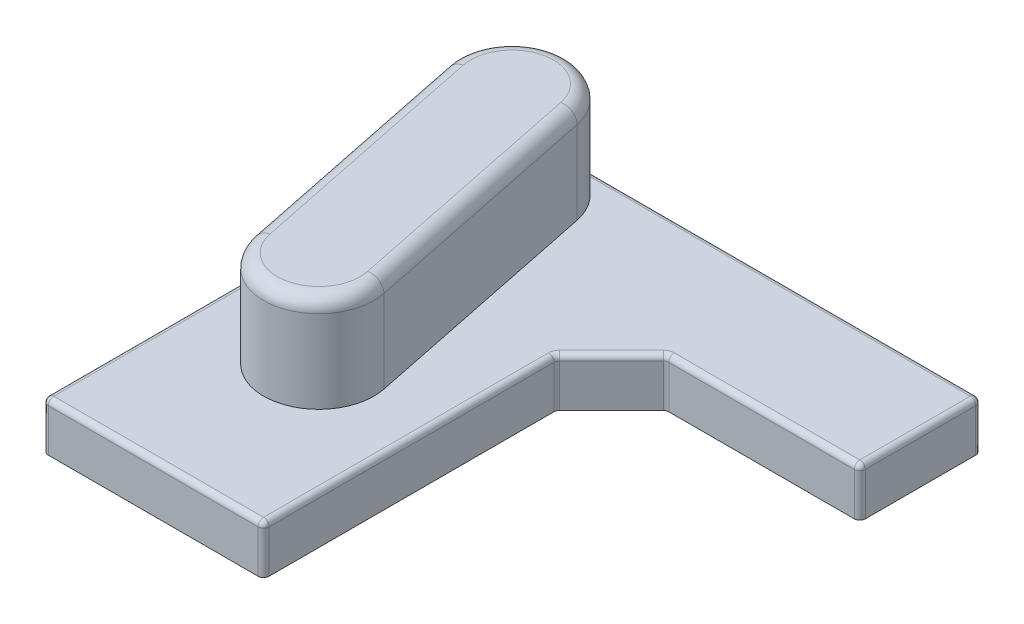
ISO-10303-21;
HEADER;
FILE_DESCRIPTION(('STEP AP214'),'2;1');
FILE_NAME('part.step','',(''),(''),'','','');
FILE_SCHEMA(('AUTOMOTIVE_DESIGN { 1 0 10303 214 1 1 1 1 }'));
ENDSEC;
DATA;
#1=APPLICATION_CONTEXT('core data for automotive mechanical design processes');
#2=APPLICATION_PROTOCOL_DEFINITION('international standard','automotive_design',2000,#1);
#3=PRODUCT_CONTEXT('',#1,'mechanical');
#4=PRODUCT('Part','Part','',(#3));
#5=PRODUCT_RELATED_PRODUCT_CATEGORY('part','',(#4));
#6=PRODUCT_DEFINITION_FORMATION('','',#4);
#7=PRODUCT_DEFINITION_CONTEXT('part definition',#1,'design');
#8=PRODUCT_DEFINITION('design','',#6,#7);
#9=PRODUCT_DEFINITION_SHAPE('','',#8);
#10=(LENGTH_UNIT() NAMED_UNIT(*) SI_UNIT(.MILLI.,.METRE.));
#11=(NAMED_UNIT(*) PLANE_ANGLE_UNIT() SI_UNIT($,.RADIAN.));
#12=(NAMED_UNIT(*) SI_UNIT($,.STERADIAN.) SOLID_ANGLE_UNIT());
#13=UNCERTAINTY_MEASURE_WITH_UNIT(LENGTH_MEASURE(1.E-05),#10,'distance_accuracy_value','');
#14=(GEOMETRIC_REPRESENTATION_CONTEXT(3) GLOBAL_UNCERTAINTY_ASSIGNED_CONTEXT((#13)) GLOBAL_UNIT_ASSIGNED_CONTEXT((#10,
#11,#12)) REPRESENTATION_CONTEXT('',''));
#15=CARTESIAN_POINT('',(0.,0.,0.));
#16=DIRECTION('',(0.,0.,1.));
#17=DIRECTION('',(1.,0.,0.));
#18=AXIS2_PLACEMENT_3D('',#15,#16,#17);
#19=CARTESIAN_POINT('',(0.,17.5,0.));
#20=DIRECTION('',(0.,-1.,0.));
#21=DIRECTION('',(0.,0.,-1.));
#22=AXIS2_PLACEMENT_3D('',#19,#20,#21);
#23=PLANE('',#22);
#24=CARTESIAN_POINT('',(22.,17.5,-148.));
#25=DIRECTION('',(0.,1.,0.));
#26=DIRECTION('',(0.,0.,1.));
#27=AXIS2_PLACEMENT_3D('',#24,#25,#26);
#28=CIRCLE('',#27,20.);
#29=CARTESIAN_POINT('',(41.5942986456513,17.5,-152.007924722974));
#30=VERTEX_POINT('',#29);
#31=CARTESIAN_POINT('',(22.,17.5,-168.));
#32=VERTEX_POINT('',#31);
#33=EDGE_CURVE('E250',#30,#32,#28,.T.);
#34=ORIENTED_EDGE('',*,*,#33,.F.);
#35=DIRECTION('',(-0.200396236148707,0.,-0.979714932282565));
#36=VECTOR('',#35,1.);
#37=CARTESIAN_POINT('',(41.5942986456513,17.5,-152.007924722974));
#38=LINE('',#37,#36);
#39=CARTESIAN_POINT('',(59.5942986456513,17.5,-64.0079247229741));
#40=VERTEX_POINT('',#39);
#41=EDGE_CURVE('E372',#40,#30,#38,.T.);
#42=ORIENTED_EDGE('',*,*,#41,.F.);
#43=CARTESIAN_POINT('',(40.,17.5,-60.));
#44=DIRECTION('',(0.,1.,0.));
#45=DIRECTION('',(0.,0.,1.));
#46=AXIS2_PLACEMENT_3D('',#43,#44,#45);
#47=CIRCLE('',#46,20.);
#48=CARTESIAN_POINT('',(20.4057013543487,17.5,-55.9920752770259));
#49=VERTEX_POINT('',#48);
#50=EDGE_CURVE('E920',#49,#40,#47,.T.);
#51=ORIENTED_EDGE('',*,*,#50,.F.);
#52=DIRECTION('',(0.200396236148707,0.,0.979714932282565));
#53=VECTOR('',#52,1.);
#54=CARTESIAN_POINT('',(2.40570135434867,17.5,-143.992075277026));
#55=LINE('',#54,#53);
#56=CARTESIAN_POINT('',(2.40570135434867,17.5,-143.992075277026));
#57=VERTEX_POINT('',#56);
#58=EDGE_CURVE('E248',#57,#49,#55,.T.);
#59=ORIENTED_EDGE('',*,*,#58,.F.);
#60=CARTESIAN_POINT('',(1.99999999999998,17.5,-148.));
#61=VERTEX_POINT('',#60);
#62=EDGE_CURVE('E244',#61,#57,#28,.T.);
#63=ORIENTED_EDGE('',*,*,#62,.F.);
#64=DIRECTION('',(0.,0.,1.));
#65=VECTOR('',#64,1.);
#66=CARTESIAN_POINT('',(2.,17.5,0.));
#67=LINE('',#66,#65);
#68=CARTESIAN_POINT('',(2.,17.5,-2.));
#69=VERTEX_POINT('',#68);
#70=EDGE_CURVE('E233',#61,#69,#67,.T.);
#71=ORIENTED_EDGE('',*,*,#70,.T.);
#72=DIRECTION('',(1.,0.,0.));
#73=VECTOR('',#72,1.);
#74=CARTESIAN_POINT('',(0.,17.5,-2.));
#75=LINE('',#74,#73);
#76=CARTESIAN_POINT('',(78.,17.5,-2.));
#77=VERTEX_POINT('',#76);
#78=EDGE_CURVE('E240',#69,#77,#75,.T.);
#79=ORIENTED_EDGE('',*,*,#78,.T.);
#80=DIRECTION('',(0.,0.,-1.));
#81=VECTOR('',#80,1.);
#82=CARTESIAN_POINT('',(78.,17.5,0.));
#83=LINE('',#82,#81);
#84=CARTESIAN_POINT('',(78.,17.5,-105.191548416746));
#85=VERTEX_POINT('',#84);
#86=EDGE_CURVE('E261',#77,#85,#83,.T.);
#87=ORIENTED_EDGE('',*,*,#86,.T.);
#88=CARTESIAN_POINT('',(82.,17.5,-105.191548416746));
#89=DIRECTION('',(0.,-1.,0.));
#90=DIRECTION('',(0.,0.,-1.));
#91=AXIS2_PLACEMENT_3D('',#88,#89,#90);
#92=CIRCLE('',#91,4.);
#93=CARTESIAN_POINT('',(79.1715728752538,17.5,-108.019975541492));
#94=VERTEX_POINT('',#93);
#95=EDGE_CURVE('E263',#85,#94,#92,.T.);
#96=ORIENTED_EDGE('',*,*,#95,.T.);
#97=DIRECTION('',(0.707106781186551,0.,-0.707106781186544));
#98=VECTOR('',#97,1.);
#99=CARTESIAN_POINT('',(-14.4242013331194,17.5,-14.4242013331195));
#100=LINE('',#99,#98);
#101=CARTESIAN_POINT('',(97.9800244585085,17.5,-126.828427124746));
#102=VERTEX_POINT('',#101);
#103=EDGE_CURVE('E265',#94,#102,#100,.T.);
#104=ORIENTED_EDGE('',*,*,#103,.T.);
#105=CARTESIAN_POINT('',(100.808451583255,17.5,-124.));
#106=DIRECTION('',(0.,-1.,0.));
#107=DIRECTION('',(0.,0.,-1.));
#108=AXIS2_PLACEMENT_3D('',#105,#106,#107);
#109=CIRCLE('',#108,4.);
#110=CARTESIAN_POINT('',(100.808451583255,17.5,-128.));
#111=VERTEX_POINT('',#110);
#112=EDGE_CURVE('E267',#102,#111,#109,.T.);
#113=ORIENTED_EDGE('',*,*,#112,.T.);
#114=DIRECTION('',(1.,0.,0.));
#115=VECTOR('',#114,1.);
#116=CARTESIAN_POINT('',(0.,17.5,-128.));
#117=LINE('',#116,#115);
#118=CARTESIAN_POINT('',(168.,17.5,-128.));
#119=VERTEX_POINT('',#118);
#120=EDGE_CURVE('E269',#111,#119,#117,.T.);
#121=ORIENTED_EDGE('',*,*,#120,.T.);
#122=DIRECTION('',(0.,0.,-1.));
#123=VECTOR('',#122,1.);
#124=CARTESIAN_POINT('',(168.,17.5,0.));
#125=LINE('',#124,#123);
#126=CARTESIAN_POINT('',(168.,17.5,-168.));
#127=VERTEX_POINT('',#126);
#128=EDGE_CURVE('E256',#119,#127,#125,.T.);
#129=ORIENTED_EDGE('',*,*,#128,.T.);
#130=DIRECTION('',(-1.,0.,0.));
#131=VECTOR('',#130,1.);
#132=CARTESIAN_POINT('',(0.,17.5,-168.));
#133=LINE('',#132,#131);
#134=EDGE_CURVE('E254',#127,#32,#133,.T.);
#135=ORIENTED_EDGE('',*,*,#134,.T.);
#136=EDGE_LOOP('',(#34,#42,#51,#59,#63,#71,#79,#87,#96,#104,#113,#121,#129,#135));
#137=FACE_BOUND('',#136,.T.);
#138=ADVANCED_FACE('F50',(#137),#23,.F.);
#139=CARTESIAN_POINT('',(80.,17.5,0.));
#140=DIRECTION('',(0.,0.,-1.));
#141=DIRECTION('',(-1.,0.,0.));
#142=AXIS2_PLACEMENT_3D('',#139,#140,#141);
#143=PLANE('',#142);
#144=DIRECTION('',(0.,-1.,0.));
#145=VECTOR('',#144,1.);
#146=CARTESIAN_POINT('',(78.,17.5,0.));
#147=LINE('',#146,#145);
#148=CARTESIAN_POINT('',(78.,0.,0.));
#149=VERTEX_POINT('',#148);
#150=CARTESIAN_POINT('',(78.,15.5,0.));
#151=VERTEX_POINT('',#150);
#152=EDGE_CURVE('E848',#149,#151,#147,.F.);
#153=ORIENTED_EDGE('',*,*,#152,.T.);
#154=DIRECTION('',(1.,0.,0.));
#155=VECTOR('',#154,1.);
#156=CARTESIAN_POINT('',(80.,15.5,0.));
#157=LINE('',#156,#155);
#158=CARTESIAN_POINT('',(2.,15.5,0.));
#159=VERTEX_POINT('',#158);
#160=EDGE_CURVE('E284',#151,#159,#157,.F.);
#161=ORIENTED_EDGE('',*,*,#160,.T.);
#162=DIRECTION('',(0.,-1.,0.));
#163=VECTOR('',#162,1.);
#164=CARTESIAN_POINT('',(2.,17.5,0.));
#165=LINE('',#164,#163);
#166=CARTESIAN_POINT('',(2.,0.,0.));
#167=VERTEX_POINT('',#166);
#168=EDGE_CURVE('E846',#159,#167,#165,.T.);
#169=ORIENTED_EDGE('',*,*,#168,.T.);
#170=DIRECTION('',(1.,0.,0.));
#171=VECTOR('',#170,1.);
#172=CARTESIAN_POINT('',(80.,0.,0.));
#173=LINE('',#172,#171);
#174=EDGE_CURVE('E331',#167,#149,#173,.T.);
#175=ORIENTED_EDGE('',*,*,#174,.T.);
#176=EDGE_LOOP('',(#153,#161,#169,#175));
#177=FACE_BOUND('',#176,.T.);
#178=ADVANCED_FACE('F389',(#177),#143,.F.);
#179=CARTESIAN_POINT('',(80.,17.5,-106.019975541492));
#180=DIRECTION('',(-1.,0.,0.));
#181=DIRECTION('',(0.,0.,1.));
#182=AXIS2_PLACEMENT_3D('',#179,#180,#181);
#183=PLANE('',#182);
#184=DIRECTION('',(0.,-1.,0.));
#185=VECTOR('',#184,1.);
#186=CARTESIAN_POINT('',(80.,17.5,-105.191548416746));
#187=LINE('',#186,#185);
#188=CARTESIAN_POINT('',(80.,0.,-105.191548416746));
#189=VERTEX_POINT('',#188);
#190=CARTESIAN_POINT('',(80.,15.5,-105.191548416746));
#191=VERTEX_POINT('',#190);
#192=EDGE_CURVE('E843',#189,#191,#187,.F.);
#193=ORIENTED_EDGE('',*,*,#192,.T.);
#194=DIRECTION('',(0.,0.,-1.));
#195=VECTOR('',#194,1.);
#196=CARTESIAN_POINT('',(80.,15.5,-106.019975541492));
#197=LINE('',#196,#195);
#198=CARTESIAN_POINT('',(80.,15.5,-2.));
#199=VERTEX_POINT('',#198);
#200=EDGE_CURVE('E280',#191,#199,#197,.F.);
#201=ORIENTED_EDGE('',*,*,#200,.T.);
#202=DIRECTION('',(0.,-1.,0.));
#203=VECTOR('',#202,1.);
#204=CARTESIAN_POINT('',(80.,17.5,-2.));
#205=LINE('',#204,#203);
#206=CARTESIAN_POINT('',(80.,0.,-2.));
#207=VERTEX_POINT('',#206);
#208=EDGE_CURVE('E841',#199,#207,#205,.T.);
#209=ORIENTED_EDGE('',*,*,#208,.T.);
#210=DIRECTION('',(0.,0.,-1.));
#211=VECTOR('',#210,1.);
#212=CARTESIAN_POINT('',(80.,0.,-106.019975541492));
#213=LINE('',#212,#211);
#214=EDGE_CURVE('E791',#207,#189,#213,.T.);
#215=ORIENTED_EDGE('',*,*,#214,.T.);
#216=EDGE_LOOP('',(#193,#201,#209,#215));
#217=FACE_BOUND('',#216,.T.);
#218=ADVANCED_FACE('F396',(#217),#183,.F.);
#219=CARTESIAN_POINT('',(80.,17.5,-106.019975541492));
#220=DIRECTION('',(-0.707106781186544,0.,-0.707106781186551));
#221=DIRECTION('',(-0.707106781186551,0.,0.707106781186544));
#222=AXIS2_PLACEMENT_3D('',#219,#220,#221);
#223=PLANE('',#222);
#224=DIRECTION('',(0.,-1.,0.));
#225=VECTOR('',#224,1.);
#226=CARTESIAN_POINT('',(99.3942380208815,17.5,-125.414213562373));
#227=LINE('',#226,#225);
#228=CARTESIAN_POINT('',(99.3942380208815,0.,-125.414213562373));
#229=VERTEX_POINT('',#228);
#230=CARTESIAN_POINT('',(99.3942380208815,15.5,-125.414213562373));
#231=VERTEX_POINT('',#230);
#232=EDGE_CURVE('E836',#229,#231,#227,.F.);
#233=ORIENTED_EDGE('',*,*,#232,.T.);
#234=DIRECTION('',(0.707106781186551,0.,-0.707106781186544));
#235=VECTOR('',#234,1.);
#236=CARTESIAN_POINT('',(80.,15.5,-106.019975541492));
#237=LINE('',#236,#235);
#238=CARTESIAN_POINT('',(80.5857864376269,15.5,-106.605761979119));
#239=VERTEX_POINT('',#238);
#240=EDGE_CURVE('E276',#231,#239,#237,.F.);
#241=ORIENTED_EDGE('',*,*,#240,.T.);
#242=DIRECTION('',(0.,-1.,0.));
#243=VECTOR('',#242,1.);
#244=CARTESIAN_POINT('',(80.5857864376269,0.,-106.605761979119));
#245=LINE('',#244,#243);
#246=CARTESIAN_POINT('',(80.5857864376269,0.,-106.605761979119));
#247=VERTEX_POINT('',#246);
#248=EDGE_CURVE('E839',#239,#247,#245,.T.);
#249=ORIENTED_EDGE('',*,*,#248,.T.);
#250=DIRECTION('',(0.707106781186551,0.,-0.707106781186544));
#251=VECTOR('',#250,1.);
#252=CARTESIAN_POINT('',(80.,0.,-106.019975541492));
#253=LINE('',#252,#251);
#254=EDGE_CURVE('E794',#247,#229,#253,.T.);
#255=ORIENTED_EDGE('',*,*,#254,.T.);
#256=EDGE_LOOP('',(#233,#241,#249,#255));
#257=FACE_BOUND('',#256,.T.);
#258=ADVANCED_FACE('F423',(#257),#223,.F.);
#259=CARTESIAN_POINT('',(170.,17.5,-126.));
#260=DIRECTION('',(0.,0.,-1.));
#261=DIRECTION('',(-1.,0.,0.));
#262=AXIS2_PLACEMENT_3D('',#259,#260,#261);
#263=PLANE('',#262);
#264=DIRECTION('',(0.,-1.,0.));
#265=VECTOR('',#264,1.);
#266=CARTESIAN_POINT('',(168.,17.5,-126.));
#267=LINE('',#266,#265);
#268=CARTESIAN_POINT('',(168.,0.,-126.));
#269=VERTEX_POINT('',#268);
#270=CARTESIAN_POINT('',(168.,15.5,-126.));
#271=VERTEX_POINT('',#270);
#272=EDGE_CURVE('E833',#269,#271,#267,.F.);
#273=ORIENTED_EDGE('',*,*,#272,.T.);
#274=DIRECTION('',(1.,0.,0.));
#275=VECTOR('',#274,1.);
#276=CARTESIAN_POINT('',(170.,15.5,-126.));
#277=LINE('',#276,#275);
#278=CARTESIAN_POINT('',(100.808451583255,15.5,-126.));
#279=VERTEX_POINT('',#278);
#280=EDGE_CURVE('E272',#271,#279,#277,.F.);
#281=ORIENTED_EDGE('',*,*,#280,.T.);
#282=DIRECTION('',(0.,-1.,0.));
#283=VECTOR('',#282,1.);
#284=CARTESIAN_POINT('',(100.808451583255,0.,-126.));
#285=LINE('',#284,#283);
#286=CARTESIAN_POINT('',(100.808451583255,0.,-126.));
#287=VERTEX_POINT('',#286);
#288=EDGE_CURVE('E831',#279,#287,#285,.T.);
#289=ORIENTED_EDGE('',*,*,#288,.T.);
#290=DIRECTION('',(1.,0.,0.));
#291=VECTOR('',#290,1.);
#292=CARTESIAN_POINT('',(170.,0.,-126.));
#293=LINE('',#292,#291);
#294=EDGE_CURVE('E797',#287,#269,#293,.T.);
#295=ORIENTED_EDGE('',*,*,#294,.T.);
#296=EDGE_LOOP('',(#273,#281,#289,#295));
#297=FACE_BOUND('',#296,.T.);
#298=ADVANCED_FACE('F419',(#297),#263,.F.);
#299=CARTESIAN_POINT('',(170.,17.5,-170.));
#300=DIRECTION('',(-1.,0.,0.));
#301=DIRECTION('',(0.,0.,1.));
#302=AXIS2_PLACEMENT_3D('',#299,#300,#301);
#303=PLANE('',#302);
#304=DIRECTION('',(0.,-1.,0.));
#305=VECTOR('',#304,1.);
#306=CARTESIAN_POINT('',(170.,17.5,-168.));
#307=LINE('',#306,#305);
#308=CARTESIAN_POINT('',(170.,0.,-168.));
#309=VERTEX_POINT('',#308);
#310=CARTESIAN_POINT('',(170.,15.5,-168.));
#311=VERTEX_POINT('',#310);
#312=EDGE_CURVE('E828',#309,#311,#307,.F.);
#313=ORIENTED_EDGE('',*,*,#312,.T.);
#314=DIRECTION('',(0.,0.,-1.));
#315=VECTOR('',#314,1.);
#316=CARTESIAN_POINT('',(170.,15.5,-170.));
#317=LINE('',#316,#315);
#318=CARTESIAN_POINT('',(170.,15.5,-128.));
#319=VERTEX_POINT('',#318);
#320=EDGE_CURVE('E295',#311,#319,#317,.F.);
#321=ORIENTED_EDGE('',*,*,#320,.T.);
#322=DIRECTION('',(0.,-1.,0.));
#323=VECTOR('',#322,1.);
#324=CARTESIAN_POINT('',(170.,17.5,-128.));
#325=LINE('',#324,#323);
#326=CARTESIAN_POINT('',(170.,0.,-128.));
#327=VERTEX_POINT('',#326);
#328=EDGE_CURVE('E826',#319,#327,#325,.T.);
#329=ORIENTED_EDGE('',*,*,#328,.T.);
#330=DIRECTION('',(0.,0.,-1.));
#331=VECTOR('',#330,1.);
#332=CARTESIAN_POINT('',(170.,0.,-170.));
#333=LINE('',#332,#331);
#334=EDGE_CURVE('E800',#327,#309,#333,.T.);
#335=ORIENTED_EDGE('',*,*,#334,.T.);
#336=EDGE_LOOP('',(#313,#321,#329,#335));
#337=FACE_BOUND('',#336,.T.);
#338=ADVANCED_FACE('F415',(#337),#303,.F.);
#339=CARTESIAN_POINT('',(0.,17.5,-170.));
#340=DIRECTION('',(0.,0.,1.));
#341=DIRECTION('',(1.,0.,0.));
#342=AXIS2_PLACEMENT_3D('',#339,#340,#341);
#343=PLANE('',#342);
#344=DIRECTION('',(0.,-1.,0.));
#345=VECTOR('',#344,1.);
#346=CARTESIAN_POINT('',(22.,17.5,-170.));
#347=LINE('',#346,#345);
#348=CARTESIAN_POINT('',(22.,0.,-170.));
#349=VERTEX_POINT('',#348);
#350=CARTESIAN_POINT('',(22.,15.5,-170.));
#351=VERTEX_POINT('',#350);
#352=EDGE_CURVE('E813',#349,#351,#347,.F.);
#353=ORIENTED_EDGE('',*,*,#352,.T.);
#354=DIRECTION('',(-1.,0.,0.));
#355=VECTOR('',#354,1.);
#356=CARTESIAN_POINT('',(0.,15.5,-170.));
#357=LINE('',#356,#355);
#358=CARTESIAN_POINT('',(168.,15.5,-170.));
#359=VERTEX_POINT('',#358);
#360=EDGE_CURVE('E291',#351,#359,#357,.F.);
#361=ORIENTED_EDGE('',*,*,#360,.T.);
#362=DIRECTION('',(0.,-1.,0.));
#363=VECTOR('',#362,1.);
#364=CARTESIAN_POINT('',(168.,17.5,-170.));
#365=LINE('',#364,#363);
#366=CARTESIAN_POINT('',(168.,0.,-170.));
#367=VERTEX_POINT('',#366);
#368=EDGE_CURVE('E816',#359,#367,#365,.T.);
#369=ORIENTED_EDGE('',*,*,#368,.T.);
#370=DIRECTION('',(-1.,0.,0.));
#371=VECTOR('',#370,1.);
#372=CARTESIAN_POINT('',(0.,0.,-170.));
#373=LINE('',#372,#371);
#374=EDGE_CURVE('E803',#367,#349,#373,.T.);
#375=ORIENTED_EDGE('',*,*,#374,.T.);
#376=EDGE_LOOP('',(#353,#361,#369,#375));
#377=FACE_BOUND('',#376,.T.);
#378=ADVANCED_FACE('F411',(#377),#343,.F.);
#379=CARTESIAN_POINT('',(0.,17.5,0.));
#380=DIRECTION('',(1.,0.,0.));
#381=DIRECTION('',(0.,0.,-1.));
#382=AXIS2_PLACEMENT_3D('',#379,#380,#381);
#383=PLANE('',#382);
#384=DIRECTION('',(0.,-1.,0.));
#385=VECTOR('',#384,1.);
#386=CARTESIAN_POINT('',(0.,17.5,-2.));
#387=LINE('',#386,#385);
#388=CARTESIAN_POINT('',(0.,0.,-2.));
#389=VERTEX_POINT('',#388);
#390=CARTESIAN_POINT('',(0.,15.5,-2.));
#391=VERTEX_POINT('',#390);
#392=EDGE_CURVE('E851',#389,#391,#387,.F.);
#393=ORIENTED_EDGE('',*,*,#392,.T.);
#394=DIRECTION('',(0.,0.,1.));
#395=VECTOR('',#394,1.);
#396=CARTESIAN_POINT('',(0.,15.5,0.));
#397=LINE('',#396,#395);
#398=CARTESIAN_POINT('',(0.,15.5,-148.));
#399=VERTEX_POINT('',#398);
#400=EDGE_CURVE('E288',#391,#399,#397,.F.);
#401=ORIENTED_EDGE('',*,*,#400,.T.);
#402=DIRECTION('',(0.,-1.,0.));
#403=VECTOR('',#402,1.);
#404=CARTESIAN_POINT('',(0.,17.5,-148.));
#405=LINE('',#404,#403);
#406=CARTESIAN_POINT('',(0.,0.,-148.));
#407=VERTEX_POINT('',#406);
#408=EDGE_CURVE('E808',#399,#407,#405,.T.);
#409=ORIENTED_EDGE('',*,*,#408,.T.);
#410=DIRECTION('',(0.,0.,1.));
#411=VECTOR('',#410,1.);
#412=CARTESIAN_POINT('',(0.,0.,0.));
#413=LINE('',#412,#411);
#414=EDGE_CURVE('E805',#407,#389,#413,.T.);
#415=ORIENTED_EDGE('',*,*,#414,.T.);
#416=EDGE_LOOP('',(#393,#401,#409,#415));
#417=FACE_BOUND('',#416,.T.);
#418=ADVANCED_FACE('F407',(#417),#383,.F.);
#419=CARTESIAN_POINT('',(0.,0.,0.));
#420=DIRECTION('',(0.,-1.,0.));
#421=DIRECTION('',(0.,0.,-1.));
#422=AXIS2_PLACEMENT_3D('',#419,#420,#421);
#423=PLANE('',#422);
#424=CARTESIAN_POINT('',(40.,0.,-60.));
#425=DIRECTION('',(0.,-1.,0.));
#426=DIRECTION('',(0.,0.,-1.));
#427=AXIS2_PLACEMENT_3D('',#424,#425,#426);
#428=CIRCLE('',#427,19.);
#429=CARTESIAN_POINT('',(40.,0.,-79.));
#430=VERTEX_POINT('',#429);
#431=EDGE_CURVE('E783',#430,#430,#428,.T.);
#432=ORIENTED_EDGE('',*,*,#431,.F.);
#433=EDGE_LOOP('',(#432));
#434=FACE_BOUND('',#433,.T.);
#435=ORIENTED_EDGE('',*,*,#374,.F.);
#436=CARTESIAN_POINT('',(168.,0.,-168.));
#437=DIRECTION('',(0.,-1.,0.));
#438=DIRECTION('',(0.,0.,-1.));
#439=AXIS2_PLACEMENT_3D('',#436,#437,#438);
#440=CIRCLE('',#439,2.);
#441=EDGE_CURVE('E824',#367,#309,#440,.T.);
#442=ORIENTED_EDGE('',*,*,#441,.T.);
#443=ORIENTED_EDGE('',*,*,#334,.F.);
#444=CARTESIAN_POINT('',(168.,0.,-128.));
#445=DIRECTION('',(0.,-1.,0.));
#446=DIRECTION('',(0.,0.,-1.));
#447=AXIS2_PLACEMENT_3D('',#444,#445,#446);
#448=CIRCLE('',#447,2.);
#449=EDGE_CURVE('E822',#327,#269,#448,.T.);
#450=ORIENTED_EDGE('',*,*,#449,.T.);
#451=ORIENTED_EDGE('',*,*,#294,.F.);
#452=CARTESIAN_POINT('',(100.808451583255,0.,-124.));
#453=DIRECTION('',(0.,-1.,0.));
#454=DIRECTION('',(0.,0.,-1.));
#455=AXIS2_PLACEMENT_3D('',#452,#453,#454);
#456=CIRCLE('',#455,2.);
#457=EDGE_CURVE('E856',#287,#229,#456,.F.);
#458=ORIENTED_EDGE('',*,*,#457,.T.);
#459=ORIENTED_EDGE('',*,*,#254,.F.);
#460=CARTESIAN_POINT('',(82.,0.,-105.191548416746));
#461=DIRECTION('',(0.,-1.,0.));
#462=DIRECTION('',(0.,0.,-1.));
#463=AXIS2_PLACEMENT_3D('',#460,#461,#462);
#464=CIRCLE('',#463,2.);
#465=EDGE_CURVE('E854',#247,#189,#464,.F.);
#466=ORIENTED_EDGE('',*,*,#465,.T.);
#467=ORIENTED_EDGE('',*,*,#214,.F.);
#468=CARTESIAN_POINT('',(78.,0.,-2.));
#469=DIRECTION('',(0.,-1.,0.));
#470=DIRECTION('',(0.,0.,-1.));
#471=AXIS2_PLACEMENT_3D('',#468,#469,#470);
#472=CIRCLE('',#471,2.);
#473=EDGE_CURVE('E820',#207,#149,#472,.T.);
#474=ORIENTED_EDGE('',*,*,#473,.T.);
#475=ORIENTED_EDGE('',*,*,#174,.F.);
#476=CARTESIAN_POINT('',(2.,0.,-2.));
#477=DIRECTION('',(0.,-1.,0.));
#478=DIRECTION('',(0.,0.,-1.));
#479=AXIS2_PLACEMENT_3D('',#476,#477,#478);
#480=CIRCLE('',#479,2.);
#481=EDGE_CURVE('E818',#167,#389,#480,.T.);
#482=ORIENTED_EDGE('',*,*,#481,.T.);
#483=ORIENTED_EDGE('',*,*,#414,.F.);
#484=CARTESIAN_POINT('',(22.,0.,-148.));
#485=DIRECTION('',(0.,-1.,0.));
#486=DIRECTION('',(0.,0.,-1.));
#487=AXIS2_PLACEMENT_3D('',#484,#485,#486);
#488=CIRCLE('',#487,22.);
#489=EDGE_CURVE('E810',#407,#349,#488,.T.);
#490=ORIENTED_EDGE('',*,*,#489,.T.);
#491=EDGE_LOOP('',(#435,#442,#443,#450,#451,#458,#459,#466,#467,#474,#475,#482,#483,#490));
#492=FACE_BOUND('',#491,.T.);
#493=ADVANCED_FACE('F403',(#434,#492),#423,.T.);
#494=CARTESIAN_POINT('',(22.,17.5,-148.));
#495=DIRECTION('',(0.,-1.,0.));
#496=DIRECTION('',(0.,0.,-1.));
#497=AXIS2_PLACEMENT_3D('',#494,#495,#496);
#498=CYLINDRICAL_SURFACE('',#497,22.);
#499=ORIENTED_EDGE('',*,*,#408,.F.);
#500=CARTESIAN_POINT('',(22.,15.5,-148.));
#501=DIRECTION('',(0.,-1.,0.));
#502=DIRECTION('',(0.,0.,-1.));
#503=AXIS2_PLACEMENT_3D('',#500,#501,#502);
#504=CIRCLE('',#503,22.);
#505=EDGE_CURVE('E226',#399,#351,#504,.T.);
#506=ORIENTED_EDGE('',*,*,#505,.T.);
#507=ORIENTED_EDGE('',*,*,#352,.F.);
#508=ORIENTED_EDGE('',*,*,#489,.F.);
#509=EDGE_LOOP('',(#499,#506,#507,#508));
#510=FACE_BOUND('',#509,.T.);
#511=ADVANCED_FACE('F406',(#510),#498,.T.);
#512=CARTESIAN_POINT('',(168.,17.5,-168.));
#513=DIRECTION('',(0.,-1.,0.));
#514=DIRECTION('',(0.,0.,-1.));
#515=AXIS2_PLACEMENT_3D('',#512,#513,#514);
#516=CYLINDRICAL_SURFACE('',#515,2.);
#517=ORIENTED_EDGE('',*,*,#368,.F.);
#518=CARTESIAN_POINT('',(168.,15.5,-168.));
#519=DIRECTION('',(0.,-1.,0.));
#520=DIRECTION('',(0.,0.,-1.));
#521=AXIS2_PLACEMENT_3D('',#518,#519,#520);
#522=CIRCLE('',#521,2.);
#523=EDGE_CURVE('E293',#359,#311,#522,.T.);
#524=ORIENTED_EDGE('',*,*,#523,.T.);
#525=ORIENTED_EDGE('',*,*,#312,.F.);
#526=ORIENTED_EDGE('',*,*,#441,.F.);
#527=EDGE_LOOP('',(#517,#524,#525,#526));
#528=FACE_BOUND('',#527,.T.);
#529=ADVANCED_FACE('F433',(#528),#516,.T.);
#530=CARTESIAN_POINT('',(168.,17.5,-128.));
#531=DIRECTION('',(0.,-1.,0.));
#532=DIRECTION('',(0.,0.,-1.));
#533=AXIS2_PLACEMENT_3D('',#530,#531,#532);
#534=CYLINDRICAL_SURFACE('',#533,2.);
#535=ORIENTED_EDGE('',*,*,#328,.F.);
#536=CARTESIAN_POINT('',(168.,15.5,-128.));
#537=DIRECTION('',(0.,-1.,0.));
#538=DIRECTION('',(0.,0.,-1.));
#539=AXIS2_PLACEMENT_3D('',#536,#537,#538);
#540=CIRCLE('',#539,2.);
#541=EDGE_CURVE('E858',#319,#271,#540,.T.);
#542=ORIENTED_EDGE('',*,*,#541,.T.);
#543=ORIENTED_EDGE('',*,*,#272,.F.);
#544=ORIENTED_EDGE('',*,*,#449,.F.);
#545=EDGE_LOOP('',(#535,#542,#543,#544));
#546=FACE_BOUND('',#545,.T.);
#547=ADVANCED_FACE('F437',(#546),#534,.T.);
#548=CARTESIAN_POINT('',(82.,17.5,-105.191548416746));
#549=DIRECTION('',(0.,1.,0.));
#550=DIRECTION('',(0.,0.,1.));
#551=AXIS2_PLACEMENT_3D('',#548,#549,#550);
#552=CYLINDRICAL_SURFACE('',#551,2.);
#553=ORIENTED_EDGE('',*,*,#248,.F.);
#554=CARTESIAN_POINT('',(82.,15.5,-105.191548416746));
#555=DIRECTION('',(0.,-1.,0.));
#556=DIRECTION('',(0.,0.,-1.));
#557=AXIS2_PLACEMENT_3D('',#554,#555,#556);
#558=CIRCLE('',#557,2.);
#559=EDGE_CURVE('E278',#239,#191,#558,.F.);
#560=ORIENTED_EDGE('',*,*,#559,.T.);
#561=ORIENTED_EDGE('',*,*,#192,.F.);
#562=ORIENTED_EDGE('',*,*,#465,.F.);
#563=EDGE_LOOP('',(#553,#560,#561,#562));
#564=FACE_BOUND('',#563,.T.);
#565=ADVANCED_FACE('F441',(#564),#552,.F.);
#566=CARTESIAN_POINT('',(100.808451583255,17.5,-124.));
#567=DIRECTION('',(0.,1.,0.));
#568=DIRECTION('',(0.,0.,1.));
#569=AXIS2_PLACEMENT_3D('',#566,#567,#568);
#570=CYLINDRICAL_SURFACE('',#569,2.);
#571=ORIENTED_EDGE('',*,*,#288,.F.);
#572=CARTESIAN_POINT('',(100.808451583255,15.5,-124.));
#573=DIRECTION('',(0.,-1.,0.));
#574=DIRECTION('',(0.,0.,-1.));
#575=AXIS2_PLACEMENT_3D('',#572,#573,#574);
#576=CIRCLE('',#575,2.);
#577=EDGE_CURVE('E274',#279,#231,#576,.F.);
#578=ORIENTED_EDGE('',*,*,#577,.T.);
#579=ORIENTED_EDGE('',*,*,#232,.F.);
#580=ORIENTED_EDGE('',*,*,#457,.F.);
#581=EDGE_LOOP('',(#571,#578,#579,#580));
#582=FACE_BOUND('',#581,.T.);
#583=ADVANCED_FACE('F445',(#582),#570,.F.);
#584=CARTESIAN_POINT('',(78.,17.5,-2.));
#585=DIRECTION('',(0.,-1.,0.));
#586=DIRECTION('',(0.,0.,-1.));
#587=AXIS2_PLACEMENT_3D('',#584,#585,#586);
#588=CYLINDRICAL_SURFACE('',#587,2.);
#589=ORIENTED_EDGE('',*,*,#208,.F.);
#590=CARTESIAN_POINT('',(78.,15.5,-2.));
#591=DIRECTION('',(0.,-1.,0.));
#592=DIRECTION('',(0.,0.,-1.));
#593=AXIS2_PLACEMENT_3D('',#590,#591,#592);
#594=CIRCLE('',#593,2.);
#595=EDGE_CURVE('E282',#199,#151,#594,.T.);
#596=ORIENTED_EDGE('',*,*,#595,.T.);
#597=ORIENTED_EDGE('',*,*,#152,.F.);
#598=ORIENTED_EDGE('',*,*,#473,.F.);
#599=EDGE_LOOP('',(#589,#596,#597,#598));
#600=FACE_BOUND('',#599,.T.);
#601=ADVANCED_FACE('F449',(#600),#588,.T.);
#602=CARTESIAN_POINT('',(2.,17.5,-2.));
#603=DIRECTION('',(0.,-1.,0.));
#604=DIRECTION('',(0.,0.,-1.));
#605=AXIS2_PLACEMENT_3D('',#602,#603,#604);
#606=CYLINDRICAL_SURFACE('',#605,2.);
#607=ORIENTED_EDGE('',*,*,#168,.F.);
#608=CARTESIAN_POINT('',(2.,15.5,-2.));
#609=DIRECTION('',(0.,-1.,0.));
#610=DIRECTION('',(0.,0.,-1.));
#611=AXIS2_PLACEMENT_3D('',#608,#609,#610);
#612=CIRCLE('',#611,2.);
#613=EDGE_CURVE('E286',#159,#391,#612,.T.);
#614=ORIENTED_EDGE('',*,*,#613,.T.);
#615=ORIENTED_EDGE('',*,*,#392,.F.);
#616=ORIENTED_EDGE('',*,*,#481,.F.);
#617=EDGE_LOOP('',(#607,#614,#615,#616));
#618=FACE_BOUND('',#617,.T.);
#619=ADVANCED_FACE('F453',(#618),#606,.T.);
#620=CARTESIAN_POINT('',(0.,15.5,-2.));
#621=DIRECTION('',(1.,0.,0.));
#622=DIRECTION('',(0.,0.,-1.));
#623=AXIS2_PLACEMENT_3D('',#620,#621,#622);
#624=CYLINDRICAL_SURFACE('',#623,2.);
#625=CARTESIAN_POINT('',(2.,15.5,-2.));
#626=DIRECTION('',(-1.,0.,0.));
#627=DIRECTION('',(0.,0.,1.));
#628=AXIS2_PLACEMENT_3D('',#625,#626,#627);
#629=CIRCLE('',#628,2.);
#630=EDGE_CURVE('E325',#159,#69,#629,.T.);
#631=ORIENTED_EDGE('',*,*,#630,.F.);
#632=ORIENTED_EDGE('',*,*,#160,.F.);
#633=CARTESIAN_POINT('',(78.,15.5,-2.));
#634=DIRECTION('',(1.,0.,0.));
#635=DIRECTION('',(0.,0.,-1.));
#636=AXIS2_PLACEMENT_3D('',#633,#634,#635);
#637=CIRCLE('',#636,2.);
#638=EDGE_CURVE('E328',#77,#151,#637,.T.);
#639=ORIENTED_EDGE('',*,*,#638,.F.);
#640=ORIENTED_EDGE('',*,*,#78,.F.);
#641=EDGE_LOOP('',(#631,#632,#639,#640));
#642=FACE_BOUND('',#641,.T.);
#643=ADVANCED_FACE('F457',(#642),#624,.T.);
#644=CARTESIAN_POINT('',(78.,15.5,-2.));
#645=DIRECTION('',(0.,-1.,0.));
#646=DIRECTION('',(0.,0.,-1.));
#647=AXIS2_PLACEMENT_3D('',#644,#645,#646);
#648=SPHERICAL_SURFACE('',#647,2.);
#649=ORIENTED_EDGE('',*,*,#638,.T.);
#650=ORIENTED_EDGE('',*,*,#595,.F.);
#651=CARTESIAN_POINT('',(78.,15.5,-2.));
#652=DIRECTION('',(0.,0.,-1.));
#653=DIRECTION('',(-1.,0.,0.));
#654=AXIS2_PLACEMENT_3D('',#651,#652,#653);
#655=CIRCLE('',#654,2.);
#656=EDGE_CURVE('E322',#77,#199,#655,.T.);
#657=ORIENTED_EDGE('',*,*,#656,.F.);
#658=EDGE_LOOP('',(#649,#650,#657));
#659=FACE_BOUND('',#658,.T.);
#660=ADVANCED_FACE('F501',(#659),#648,.T.);
#661=CARTESIAN_POINT('',(2.,15.5,-2.));
#662=DIRECTION('',(0.,-1.,0.));
#663=DIRECTION('',(0.,0.,-1.));
#664=AXIS2_PLACEMENT_3D('',#661,#662,#663);
#665=SPHERICAL_SURFACE('',#664,2.);
#666=ORIENTED_EDGE('',*,*,#613,.F.);
#667=ORIENTED_EDGE('',*,*,#630,.T.);
#668=CARTESIAN_POINT('',(2.,15.5,-2.));
#669=DIRECTION('',(0.,0.,-1.));
#670=DIRECTION('',(-1.,0.,0.));
#671=AXIS2_PLACEMENT_3D('',#668,#669,#670);
#672=CIRCLE('',#671,2.);
#673=EDGE_CURVE('E237',#391,#69,#672,.T.);
#674=ORIENTED_EDGE('',*,*,#673,.F.);
#675=EDGE_LOOP('',(#666,#667,#674));
#676=FACE_BOUND('',#675,.T.);
#677=ADVANCED_FACE('F497',(#676),#665,.T.);
#678=CARTESIAN_POINT('',(78.,15.5,0.));
#679=DIRECTION('',(0.,0.,-1.));
#680=DIRECTION('',(-1.,0.,0.));
#681=AXIS2_PLACEMENT_3D('',#678,#679,#680);
#682=CYLINDRICAL_SURFACE('',#681,2.);
#683=ORIENTED_EDGE('',*,*,#656,.T.);
#684=ORIENTED_EDGE('',*,*,#200,.F.);
#685=CARTESIAN_POINT('',(78.,15.5,-105.191548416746));
#686=DIRECTION('',(0.,0.,-1.));
#687=DIRECTION('',(-1.,0.,0.));
#688=AXIS2_PLACEMENT_3D('',#685,#686,#687);
#689=CIRCLE('',#688,2.);
#690=EDGE_CURVE('E229',#85,#191,#689,.T.);
#691=ORIENTED_EDGE('',*,*,#690,.F.);
#692=ORIENTED_EDGE('',*,*,#86,.F.);
#693=EDGE_LOOP('',(#683,#684,#691,#692));
#694=FACE_BOUND('',#693,.T.);
#695=ADVANCED_FACE('F494',(#694),#682,.T.);
#696=CARTESIAN_POINT('',(2.,15.5,0.));
#697=DIRECTION('',(0.,0.,1.));
#698=DIRECTION('',(1.,0.,0.));
#699=AXIS2_PLACEMENT_3D('',#696,#697,#698);
#700=CYLINDRICAL_SURFACE('',#699,2.);
#701=ORIENTED_EDGE('',*,*,#673,.T.);
#702=ORIENTED_EDGE('',*,*,#70,.F.);
#703=CARTESIAN_POINT('',(2.,15.5,-148.));
#704=DIRECTION('',(0.,0.,-1.));
#705=DIRECTION('',(-1.,0.,0.));
#706=AXIS2_PLACEMENT_3D('',#703,#704,#705);
#707=CIRCLE('',#706,2.);
#708=EDGE_CURVE('E219',#399,#61,#707,.T.);
#709=ORIENTED_EDGE('',*,*,#708,.F.);
#710=ORIENTED_EDGE('',*,*,#400,.F.);
#711=EDGE_LOOP('',(#701,#702,#709,#710));
#712=FACE_BOUND('',#711,.T.);
#713=ADVANCED_FACE('F235',(#712),#700,.T.);
#714=CARTESIAN_POINT('',(82.,15.5,-105.191548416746));
#715=DIRECTION('',(0.,-1.,0.));
#716=DIRECTION('',(0.,0.,-1.));
#717=AXIS2_PLACEMENT_3D('',#714,#715,#716);
#718=TOROIDAL_SURFACE('',#717,4.,2.);
#719=ORIENTED_EDGE('',*,*,#690,.T.);
#720=ORIENTED_EDGE('',*,*,#559,.F.);
#721=CARTESIAN_POINT('',(79.1715728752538,15.5,-108.019975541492));
#722=DIRECTION('',(0.707106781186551,0.,-0.707106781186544));
#723=DIRECTION('',(-0.707106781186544,0.,-0.707106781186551));
#724=AXIS2_PLACEMENT_3D('',#721,#722,#723);
#725=CIRCLE('',#724,2.);
#726=EDGE_CURVE('E230',#94,#239,#725,.T.);
#727=ORIENTED_EDGE('',*,*,#726,.F.);
#728=ORIENTED_EDGE('',*,*,#95,.F.);
#729=EDGE_LOOP('',(#719,#720,#727,#728));
#730=FACE_BOUND('',#729,.T.);
#731=ADVANCED_FACE('F488',(#730),#718,.T.);
#732=CARTESIAN_POINT('',(22.,15.5,-148.));
#733=DIRECTION('',(0.,-1.,0.));
#734=DIRECTION('',(0.,0.,-1.));
#735=AXIS2_PLACEMENT_3D('',#732,#733,#734);
#736=TOROIDAL_SURFACE('',#735,20.,2.);
#737=ORIENTED_EDGE('',*,*,#708,.T.);
#738=CARTESIAN_POINT('',(22.,17.5,-148.));
#739=DIRECTION('',(0.,-1.,0.));
#740=DIRECTION('',(0.,0.,-1.));
#741=AXIS2_PLACEMENT_3D('',#738,#739,#740);
#742=CIRCLE('',#741,20.);
#743=EDGE_CURVE('E224',#32,#61,#742,.F.);
#744=ORIENTED_EDGE('',*,*,#743,.F.);
#745=CARTESIAN_POINT('',(22.,15.5,-168.));
#746=DIRECTION('',(1.,0.,0.));
#747=DIRECTION('',(0.,0.,-1.));
#748=AXIS2_PLACEMENT_3D('',#745,#746,#747);
#749=CIRCLE('',#748,2.);
#750=EDGE_CURVE('E315',#351,#32,#749,.T.);
#751=ORIENTED_EDGE('',*,*,#750,.F.);
#752=ORIENTED_EDGE('',*,*,#505,.F.);
#753=EDGE_LOOP('',(#737,#744,#751,#752));
#754=FACE_BOUND('',#753,.T.);
#755=ADVANCED_FACE('F221',(#754),#736,.T.);
#756=CARTESIAN_POINT('',(-14.4242013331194,15.5,-14.4242013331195));
#757=DIRECTION('',(0.707106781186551,0.,-0.707106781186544));
#758=DIRECTION('',(-0.707106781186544,0.,-0.707106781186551));
#759=AXIS2_PLACEMENT_3D('',#756,#757,#758);
#760=CYLINDRICAL_SURFACE('',#759,2.);
#761=ORIENTED_EDGE('',*,*,#726,.T.);
#762=ORIENTED_EDGE('',*,*,#240,.F.);
#763=CARTESIAN_POINT('',(97.9800244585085,15.5,-126.828427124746));
#764=DIRECTION('',(0.707106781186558,0.,-0.707106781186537));
#765=DIRECTION('',(-0.707106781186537,0.,-0.707106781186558));
#766=AXIS2_PLACEMENT_3D('',#763,#764,#765);
#767=CIRCLE('',#766,2.);
#768=EDGE_CURVE('E312',#102,#231,#767,.T.);
#769=ORIENTED_EDGE('',*,*,#768,.F.);
#770=ORIENTED_EDGE('',*,*,#103,.F.);
#771=EDGE_LOOP('',(#761,#762,#769,#770));
#772=FACE_BOUND('',#771,.T.);
#773=ADVANCED_FACE('F482',(#772),#760,.T.);
#774=CARTESIAN_POINT('',(0.,15.5,-168.));
#775=DIRECTION('',(-1.,0.,0.));
#776=DIRECTION('',(0.,0.,1.));
#777=AXIS2_PLACEMENT_3D('',#774,#775,#776);
#778=CYLINDRICAL_SURFACE('',#777,2.);
#779=ORIENTED_EDGE('',*,*,#750,.T.);
#780=ORIENTED_EDGE('',*,*,#134,.F.);
#781=CARTESIAN_POINT('',(168.,15.5,-168.));
#782=DIRECTION('',(1.,0.,0.));
#783=DIRECTION('',(0.,0.,-1.));
#784=AXIS2_PLACEMENT_3D('',#781,#782,#783);
#785=CIRCLE('',#784,2.);
#786=EDGE_CURVE('E309',#359,#127,#785,.T.);
#787=ORIENTED_EDGE('',*,*,#786,.F.);
#788=ORIENTED_EDGE('',*,*,#360,.F.);
#789=EDGE_LOOP('',(#779,#780,#787,#788));
#790=FACE_BOUND('',#789,.T.);
#791=ADVANCED_FACE('F478',(#790),#778,.T.);
#792=CARTESIAN_POINT('',(100.808451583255,15.5,-124.));
#793=DIRECTION('',(0.,-1.,0.));
#794=DIRECTION('',(0.,0.,-1.));
#795=AXIS2_PLACEMENT_3D('',#792,#793,#794);
#796=TOROIDAL_SURFACE('',#795,4.,2.);
#797=ORIENTED_EDGE('',*,*,#768,.T.);
#798=ORIENTED_EDGE('',*,*,#577,.F.);
#799=CARTESIAN_POINT('',(100.808451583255,15.5,-128.));
#800=DIRECTION('',(1.,0.,0.));
#801=DIRECTION('',(0.,0.,-1.));
#802=AXIS2_PLACEMENT_3D('',#799,#800,#801);
#803=CIRCLE('',#802,2.);
#804=EDGE_CURVE('E306',#111,#279,#803,.T.);
#805=ORIENTED_EDGE('',*,*,#804,.F.);
#806=ORIENTED_EDGE('',*,*,#112,.F.);
#807=EDGE_LOOP('',(#797,#798,#805,#806));
#808=FACE_BOUND('',#807,.T.);
#809=ADVANCED_FACE('F474',(#808),#796,.T.);
#810=CARTESIAN_POINT('',(168.,15.5,-168.));
#811=DIRECTION('',(0.,-1.,0.));
#812=DIRECTION('',(0.,0.,-1.));
#813=AXIS2_PLACEMENT_3D('',#810,#811,#812);
#814=SPHERICAL_SURFACE('',#813,2.);
#815=ORIENTED_EDGE('',*,*,#523,.F.);
#816=ORIENTED_EDGE('',*,*,#786,.T.);
#817=CARTESIAN_POINT('',(168.,15.5,-168.));
#818=DIRECTION('',(0.,0.,1.));
#819=DIRECTION('',(1.,0.,0.));
#820=AXIS2_PLACEMENT_3D('',#817,#818,#819);
#821=CIRCLE('',#820,2.);
#822=EDGE_CURVE('E303',#311,#127,#821,.T.);
#823=ORIENTED_EDGE('',*,*,#822,.F.);
#824=EDGE_LOOP('',(#815,#816,#823));
#825=FACE_BOUND('',#824,.T.);
#826=ADVANCED_FACE('F470',(#825),#814,.T.);
#827=CARTESIAN_POINT('',(0.,15.5,-128.));
#828=DIRECTION('',(1.,0.,0.));
#829=DIRECTION('',(0.,0.,-1.));
#830=AXIS2_PLACEMENT_3D('',#827,#828,#829);
#831=CYLINDRICAL_SURFACE('',#830,2.);
#832=ORIENTED_EDGE('',*,*,#804,.T.);
#833=ORIENTED_EDGE('',*,*,#280,.F.);
#834=CARTESIAN_POINT('',(168.,15.5,-128.));
#835=DIRECTION('',(1.,0.,0.));
#836=DIRECTION('',(0.,0.,-1.));
#837=AXIS2_PLACEMENT_3D('',#834,#835,#836);
#838=CIRCLE('',#837,2.);
#839=EDGE_CURVE('E300',#119,#271,#838,.T.);
#840=ORIENTED_EDGE('',*,*,#839,.F.);
#841=ORIENTED_EDGE('',*,*,#120,.F.);
#842=EDGE_LOOP('',(#832,#833,#840,#841));
#843=FACE_BOUND('',#842,.T.);
#844=ADVANCED_FACE('F466',(#843),#831,.T.);
#845=CARTESIAN_POINT('',(168.,15.5,0.));
#846=DIRECTION('',(0.,0.,-1.));
#847=DIRECTION('',(-1.,0.,0.));
#848=AXIS2_PLACEMENT_3D('',#845,#846,#847);
#849=CYLINDRICAL_SURFACE('',#848,2.);
#850=ORIENTED_EDGE('',*,*,#822,.T.);
#851=ORIENTED_EDGE('',*,*,#128,.F.);
#852=CARTESIAN_POINT('',(168.,15.5,-128.));
#853=DIRECTION('',(0.,0.,1.));
#854=DIRECTION('',(1.,0.,0.));
#855=AXIS2_PLACEMENT_3D('',#852,#853,#854);
#856=CIRCLE('',#855,2.);
#857=EDGE_CURVE('E298',#319,#119,#856,.T.);
#858=ORIENTED_EDGE('',*,*,#857,.F.);
#859=ORIENTED_EDGE('',*,*,#320,.F.);
#860=EDGE_LOOP('',(#850,#851,#858,#859));
#861=FACE_BOUND('',#860,.T.);
#862=ADVANCED_FACE('F462',(#861),#849,.T.);
#863=CARTESIAN_POINT('',(168.,15.5,-128.));
#864=DIRECTION('',(0.,-1.,0.));
#865=DIRECTION('',(0.,0.,-1.));
#866=AXIS2_PLACEMENT_3D('',#863,#864,#865);
#867=SPHERICAL_SURFACE('',#866,2.);
#868=ORIENTED_EDGE('',*,*,#839,.T.);
#869=ORIENTED_EDGE('',*,*,#541,.F.);
#870=ORIENTED_EDGE('',*,*,#857,.T.);
#871=EDGE_LOOP('',(#868,#869,#870));
#872=FACE_BOUND('',#871,.T.);
#873=ADVANCED_FACE('F459',(#872),#867,.T.);
#874=CARTESIAN_POINT('',(40.,1.,-60.));
#875=DIRECTION('',(0.,-1.,0.));
#876=DIRECTION('',(0.,0.,-1.));
#877=AXIS2_PLACEMENT_3D('',#874,#875,#876);
#878=CYLINDRICAL_SURFACE('',#877,19.);
#879=CARTESIAN_POINT('',(40.,1.,-60.));
#880=DIRECTION('',(0.,-1.,0.));
#881=DIRECTION('',(0.,0.,-1.));
#882=AXIS2_PLACEMENT_3D('',#879,#880,#881);
#883=CIRCLE('',#882,19.);
#884=CARTESIAN_POINT('',(40.,1.,-79.));
#885=VERTEX_POINT('',#884);
#886=EDGE_CURVE('E301',#885,#885,#883,.T.);
#887=ORIENTED_EDGE('',*,*,#886,.F.);
#888=EDGE_LOOP('',(#887));
#889=FACE_BOUND('',#888,.T.);
#890=ORIENTED_EDGE('',*,*,#431,.T.);
#891=EDGE_LOOP('',(#890));
#892=FACE_BOUND('',#891,.T.);
#893=ADVANCED_FACE('F401',(#889,#892),#878,.F.);
#894=CARTESIAN_POINT('',(40.,1.,-60.));
#895=DIRECTION('',(0.,-1.,0.));
#896=DIRECTION('',(0.,0.,-1.));
#897=AXIS2_PLACEMENT_3D('',#894,#895,#896);
#898=PLANE('',#897);
#899=ORIENTED_EDGE('',*,*,#886,.T.);
#900=EDGE_LOOP('',(#899));
#901=FACE_BOUND('',#900,.T.);
#902=ADVANCED_FACE('F565',(#901),#898,.T.);
#903=CARTESIAN_POINT('',(22.,52.5,-148.));
#904=DIRECTION('',(0.,-1.,0.));
#905=DIRECTION('',(0.,0.,-1.));
#906=AXIS2_PLACEMENT_3D('',#903,#904,#905);
#907=CYLINDRICAL_SURFACE('',#906,20.);
#908=DIRECTION('',(0.,-1.,0.));
#909=VECTOR('',#908,1.);
#910=CARTESIAN_POINT('',(2.40570135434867,52.5,-143.992075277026));
#911=LINE('',#910,#909);
#912=CARTESIAN_POINT('',(2.40570135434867,47.5,-143.992075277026));
#913=VERTEX_POINT('',#912);
#914=EDGE_CURVE('E366',#913,#57,#911,.T.);
#915=ORIENTED_EDGE('',*,*,#914,.F.);
#916=CARTESIAN_POINT('',(22.,47.5,-148.));
#917=DIRECTION('',(0.,1.,0.));
#918=DIRECTION('',(0.,0.,1.));
#919=AXIS2_PLACEMENT_3D('',#916,#917,#918);
#920=CIRCLE('',#919,20.);
#921=CARTESIAN_POINT('',(41.5942986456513,47.5,-152.007924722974));
#922=VERTEX_POINT('',#921);
#923=EDGE_CURVE('E11',#913,#922,#920,.F.);
#924=ORIENTED_EDGE('',*,*,#923,.T.);
#925=DIRECTION('',(0.,-1.,0.));
#926=VECTOR('',#925,1.);
#927=CARTESIAN_POINT('',(41.5942986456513,52.5,-152.007924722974));
#928=LINE('',#927,#926);
#929=EDGE_CURVE('E365',#922,#30,#928,.T.);
#930=ORIENTED_EDGE('',*,*,#929,.T.);
#931=ORIENTED_EDGE('',*,*,#33,.T.);
#932=ORIENTED_EDGE('',*,*,#743,.T.);
#933=ORIENTED_EDGE('',*,*,#62,.T.);
#934=EDGE_LOOP('',(#915,#924,#930,#931,#932,#933));
#935=FACE_BOUND('',#934,.T.);
#936=ADVANCED_FACE('F253',(#935),#907,.T.);
#937=CARTESIAN_POINT('',(2.40570135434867,52.5,-143.992075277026));
#938=DIRECTION('',(0.979714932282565,0.,-0.200396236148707));
#939=DIRECTION('',(-0.200396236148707,0.,-0.979714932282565));
#940=AXIS2_PLACEMENT_3D('',#937,#938,#939);
#941=PLANE('',#940);
#942=DIRECTION('',(0.,-1.,0.));
#943=VECTOR('',#942,1.);
#944=CARTESIAN_POINT('',(20.4057013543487,52.5,-55.9920752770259));
#945=LINE('',#944,#943);
#946=CARTESIAN_POINT('',(20.4057013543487,47.5,-55.9920752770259));
#947=VERTEX_POINT('',#946);
#948=EDGE_CURVE('E786',#947,#49,#945,.T.);
#949=ORIENTED_EDGE('',*,*,#948,.F.);
#950=DIRECTION('',(0.200396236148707,0.,0.979714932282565));
#951=VECTOR('',#950,1.);
#952=CARTESIAN_POINT('',(2.40570135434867,47.5,-143.992075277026));
#953=LINE('',#952,#951);
#954=EDGE_CURVE('E59',#947,#913,#953,.F.);
#955=ORIENTED_EDGE('',*,*,#954,.T.);
#956=ORIENTED_EDGE('',*,*,#914,.T.);
#957=ORIENTED_EDGE('',*,*,#58,.T.);
#958=EDGE_LOOP('',(#949,#955,#956,#957));
#959=FACE_BOUND('',#958,.T.);
#960=ADVANCED_FACE('F551',(#959),#941,.F.);
#961=CARTESIAN_POINT('',(40.,52.5,-60.));
#962=DIRECTION('',(0.,-1.,0.));
#963=DIRECTION('',(0.,0.,-1.));
#964=AXIS2_PLACEMENT_3D('',#961,#962,#963);
#965=CYLINDRICAL_SURFACE('',#964,20.);
#966=DIRECTION('',(0.,-1.,0.));
#967=VECTOR('',#966,1.);
#968=CARTESIAN_POINT('',(59.5942986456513,52.5,-64.0079247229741));
#969=LINE('',#968,#967);
#970=CARTESIAN_POINT('',(59.5942986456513,47.5,-64.0079247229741));
#971=VERTEX_POINT('',#970);
#972=EDGE_CURVE('E373',#971,#40,#969,.T.);
#973=ORIENTED_EDGE('',*,*,#972,.F.);
#974=CARTESIAN_POINT('',(40.,47.5,-60.));
#975=DIRECTION('',(0.,1.,0.));
#976=DIRECTION('',(0.,0.,1.));
#977=AXIS2_PLACEMENT_3D('',#974,#975,#976);
#978=CIRCLE('',#977,20.);
#979=EDGE_CURVE('E74',#971,#947,#978,.F.);
#980=ORIENTED_EDGE('',*,*,#979,.T.);
#981=ORIENTED_EDGE('',*,*,#948,.T.);
#982=ORIENTED_EDGE('',*,*,#50,.T.);
#983=EDGE_LOOP('',(#973,#980,#981,#982));
#984=FACE_BOUND('',#983,.T.);
#985=ADVANCED_FACE('F386',(#984),#965,.T.);
#986=CARTESIAN_POINT('',(41.5942986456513,52.5,-152.007924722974));
#987=DIRECTION('',(-0.979714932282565,0.,0.200396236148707));
#988=DIRECTION('',(0.200396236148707,0.,0.979714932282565));
#989=AXIS2_PLACEMENT_3D('',#986,#987,#988);
#990=PLANE('',#989);
#991=ORIENTED_EDGE('',*,*,#929,.F.);
#992=DIRECTION('',(-0.200396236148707,0.,-0.979714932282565));
#993=VECTOR('',#992,1.);
#994=CARTESIAN_POINT('',(59.5942986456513,47.5,-64.0079247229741));
#995=LINE('',#994,#993);
#996=EDGE_CURVE('E340',#922,#971,#995,.F.);
#997=ORIENTED_EDGE('',*,*,#996,.T.);
#998=ORIENTED_EDGE('',*,*,#972,.T.);
#999=ORIENTED_EDGE('',*,*,#41,.T.);
#1000=EDGE_LOOP('',(#991,#997,#998,#999));
#1001=FACE_BOUND('',#1000,.T.);
#1002=ADVANCED_FACE('F370',(#1001),#990,.F.);
#1003=CARTESIAN_POINT('',(22.,52.5,-148.));
#1004=DIRECTION('',(0.,1.,0.));
#1005=DIRECTION('',(0.,0.,1.));
#1006=AXIS2_PLACEMENT_3D('',#1003,#1004,#1005);
#1007=PLANE('',#1006);
#1008=CARTESIAN_POINT('',(40.,52.5,-60.));
#1009=DIRECTION('',(0.,1.,0.));
#1010=DIRECTION('',(0.,0.,1.));
#1011=AXIS2_PLACEMENT_3D('',#1008,#1009,#1010);
#1012=CIRCLE('',#1011,15.);
#1013=CARTESIAN_POINT('',(25.3042760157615,52.5,-56.9940564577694));
#1014=VERTEX_POINT('',#1013);
#1015=CARTESIAN_POINT('',(54.6957239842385,52.5,-63.0059435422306));
#1016=VERTEX_POINT('',#1015);
#1017=EDGE_CURVE('E335',#1014,#1016,#1012,.T.);
#1018=ORIENTED_EDGE('',*,*,#1017,.T.);
#1019=DIRECTION('',(-0.200396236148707,0.,-0.979714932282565));
#1020=VECTOR('',#1019,1.);
#1021=CARTESIAN_POINT('',(36.6957239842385,52.5,-151.005943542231));
#1022=LINE('',#1021,#1020);
#1023=CARTESIAN_POINT('',(36.6957239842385,52.5,-151.005943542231));
#1024=VERTEX_POINT('',#1023);
#1025=EDGE_CURVE('E337',#1016,#1024,#1022,.T.);
#1026=ORIENTED_EDGE('',*,*,#1025,.T.);
#1027=CARTESIAN_POINT('',(22.,52.5,-148.));
#1028=DIRECTION('',(0.,1.,0.));
#1029=DIRECTION('',(0.,0.,1.));
#1030=AXIS2_PLACEMENT_3D('',#1027,#1028,#1029);
#1031=CIRCLE('',#1030,15.);
#1032=CARTESIAN_POINT('',(7.3042760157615,52.5,-144.994056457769));
#1033=VERTEX_POINT('',#1032);
#1034=EDGE_CURVE('E297',#1024,#1033,#1031,.T.);
#1035=ORIENTED_EDGE('',*,*,#1034,.T.);
#1036=DIRECTION('',(0.200396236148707,0.,0.979714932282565));
#1037=VECTOR('',#1036,1.);
#1038=CARTESIAN_POINT('',(25.3042760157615,52.5,-56.9940564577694));
#1039=LINE('',#1038,#1037);
#1040=EDGE_CURVE('E333',#1033,#1014,#1039,.T.);
#1041=ORIENTED_EDGE('',*,*,#1040,.T.);
#1042=EDGE_LOOP('',(#1018,#1026,#1035,#1041));
#1043=FACE_BOUND('',#1042,.T.);
#1044=ADVANCED_FACE('F379',(#1043),#1007,.T.);
#1045=CARTESIAN_POINT('',(7.3042760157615,47.5,-144.994056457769));
#1046=DIRECTION('',(-0.200396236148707,0.,-0.979714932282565));
#1047=DIRECTION('',(-0.979714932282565,0.,0.200396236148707));
#1048=AXIS2_PLACEMENT_3D('',#1045,#1046,#1047);
#1049=CYLINDRICAL_SURFACE('',#1048,5.);
#1050=CARTESIAN_POINT('',(7.3042760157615,47.5,-144.994056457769));
#1051=DIRECTION('',(-0.200396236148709,0.,-0.979714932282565));
#1052=DIRECTION('',(-0.979714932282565,0.,0.200396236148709));
#1053=AXIS2_PLACEMENT_3D('',#1050,#1051,#1052);
#1054=CIRCLE('',#1053,5.);
#1055=EDGE_CURVE('E348',#913,#1033,#1054,.T.);
#1056=ORIENTED_EDGE('',*,*,#1055,.F.);
#1057=ORIENTED_EDGE('',*,*,#954,.F.);
#1058=CARTESIAN_POINT('',(25.3042760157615,47.5,-56.9940564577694));
#1059=DIRECTION('',(0.200396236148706,0.,0.979714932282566));
#1060=DIRECTION('',(0.979714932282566,0.,-0.200396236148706));
#1061=AXIS2_PLACEMENT_3D('',#1058,#1059,#1060);
#1062=CIRCLE('',#1061,5.);
#1063=EDGE_CURVE('E54',#1014,#947,#1062,.T.);
#1064=ORIENTED_EDGE('',*,*,#1063,.F.);
#1065=ORIENTED_EDGE('',*,*,#1040,.F.);
#1066=EDGE_LOOP('',(#1056,#1057,#1064,#1065));
#1067=FACE_BOUND('',#1066,.T.);
#1068=ADVANCED_FACE('F52',(#1067),#1049,.T.);
#1069=CARTESIAN_POINT('',(40.,47.5,-60.));
#1070=DIRECTION('',(0.,1.,0.));
#1071=DIRECTION('',(0.,0.,1.));
#1072=AXIS2_PLACEMENT_3D('',#1069,#1070,#1071);
#1073=TOROIDAL_SURFACE('',#1072,15.,5.);
#1074=ORIENTED_EDGE('',*,*,#1063,.T.);
#1075=ORIENTED_EDGE('',*,*,#979,.F.);
#1076=CARTESIAN_POINT('',(54.6957239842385,47.5,-63.0059435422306));
#1077=DIRECTION('',(-0.200396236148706,0.,-0.979714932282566));
#1078=DIRECTION('',(-0.979714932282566,0.,0.200396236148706));
#1079=AXIS2_PLACEMENT_3D('',#1076,#1077,#1078);
#1080=CIRCLE('',#1079,5.);
#1081=EDGE_CURVE('E347',#1016,#971,#1080,.T.);
#1082=ORIENTED_EDGE('',*,*,#1081,.F.);
#1083=ORIENTED_EDGE('',*,*,#1017,.F.);
#1084=EDGE_LOOP('',(#1074,#1075,#1082,#1083));
#1085=FACE_BOUND('',#1084,.T.);
#1086=ADVANCED_FACE('F358',(#1085),#1073,.T.);
#1087=CARTESIAN_POINT('',(22.,47.5,-148.));
#1088=DIRECTION('',(0.,1.,0.));
#1089=DIRECTION('',(0.,0.,1.));
#1090=AXIS2_PLACEMENT_3D('',#1087,#1088,#1089);
#1091=TOROIDAL_SURFACE('',#1090,15.,5.);
#1092=ORIENTED_EDGE('',*,*,#1055,.T.);
#1093=ORIENTED_EDGE('',*,*,#1034,.F.);
#1094=CARTESIAN_POINT('',(36.6957239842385,47.5,-151.005943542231));
#1095=DIRECTION('',(0.200396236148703,0.,0.979714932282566));
#1096=DIRECTION('',(0.979714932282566,0.,-0.200396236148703));
#1097=AXIS2_PLACEMENT_3D('',#1094,#1095,#1096);
#1098=CIRCLE('',#1097,5.);
#1099=EDGE_CURVE('E345',#922,#1024,#1098,.T.);
#1100=ORIENTED_EDGE('',*,*,#1099,.F.);
#1101=ORIENTED_EDGE('',*,*,#923,.F.);
#1102=EDGE_LOOP('',(#1092,#1093,#1100,#1101));
#1103=FACE_BOUND('',#1102,.T.);
#1104=ADVANCED_FACE('F363',(#1103),#1091,.T.);
#1105=CARTESIAN_POINT('',(36.6957239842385,47.5,-151.005943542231));
#1106=DIRECTION('',(0.200396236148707,0.,0.979714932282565));
#1107=DIRECTION('',(0.979714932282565,0.,-0.200396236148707));
#1108=AXIS2_PLACEMENT_3D('',#1105,#1106,#1107);
#1109=CYLINDRICAL_SURFACE('',#1108,5.);
#1110=ORIENTED_EDGE('',*,*,#1081,.T.);
#1111=ORIENTED_EDGE('',*,*,#996,.F.);
#1112=ORIENTED_EDGE('',*,*,#1099,.T.);
#1113=ORIENTED_EDGE('',*,*,#1025,.F.);
#1114=EDGE_LOOP('',(#1110,#1111,#1112,#1113));
#1115=FACE_BOUND('',#1114,.T.);
#1116=ADVANCED_FACE('F376',(#1115),#1109,.T.);
#1117=CLOSED_SHELL('',(#138,#178,#218,#258,#298,#338,#378,#418,#493,#511,#529,#547,#565,#583,
#601,#619,#643,#660,#677,#695,#713,#731,#755,#773,#791,#809,#826,#844,#862,#873,#893,#902,#936,
#960,#985,#1002,#1044,#1068,#1086,#1104,#1116));
#1118=MANIFOLD_SOLID_BREP('B2',#1117);
#1119=ADVANCED_BREP_SHAPE_REPRESENTATION('',(#18,#1118),#14);
#1120=SHAPE_DEFINITION_REPRESENTATION(#9,#1119);
ENDSEC;
END-ISO-10303-21;
